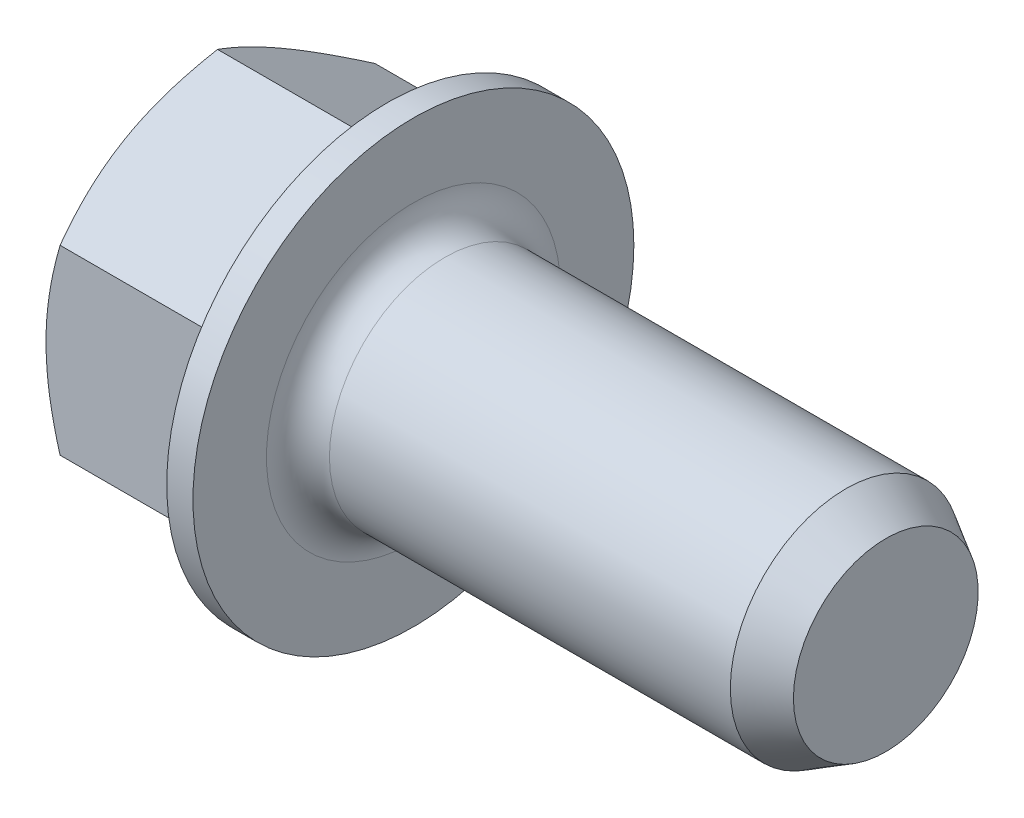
ISO-10303-21;
HEADER;
FILE_DESCRIPTION(('STEP AP214'),'2;1');
FILE_NAME('part.step','',(''),(''),'','','');
FILE_SCHEMA(('AUTOMOTIVE_DESIGN { 1 0 10303 214 1 1 1 1 }'));
ENDSEC;
DATA;
#1=APPLICATION_CONTEXT('core data for automotive mechanical design processes');
#2=APPLICATION_PROTOCOL_DEFINITION('international standard','automotive_design',2000,#1);
#3=PRODUCT_CONTEXT('',#1,'mechanical');
#4=PRODUCT('Part','Part','',(#3));
#5=PRODUCT_RELATED_PRODUCT_CATEGORY('part','',(#4));
#6=PRODUCT_DEFINITION_FORMATION('','',#4);
#7=PRODUCT_DEFINITION_CONTEXT('part definition',#1,'design');
#8=PRODUCT_DEFINITION('design','',#6,#7);
#9=PRODUCT_DEFINITION_SHAPE('','',#8);
#10=(LENGTH_UNIT() NAMED_UNIT(*) SI_UNIT(.MILLI.,.METRE.));
#11=(NAMED_UNIT(*) PLANE_ANGLE_UNIT() SI_UNIT($,.RADIAN.));
#12=(NAMED_UNIT(*) SI_UNIT($,.STERADIAN.) SOLID_ANGLE_UNIT());
#13=UNCERTAINTY_MEASURE_WITH_UNIT(LENGTH_MEASURE(1.E-05),#10,'distance_accuracy_value','');
#14=(GEOMETRIC_REPRESENTATION_CONTEXT(3) GLOBAL_UNCERTAINTY_ASSIGNED_CONTEXT((#13)) GLOBAL_UNIT_ASSIGNED_CONTEXT((#10,
#11,#12)) REPRESENTATION_CONTEXT('',''));
#15=CARTESIAN_POINT('',(0.,0.,0.));
#16=DIRECTION('',(0.,0.,1.));
#17=DIRECTION('',(1.,0.,0.));
#18=AXIS2_PLACEMENT_3D('',#15,#16,#17);
#19=CARTESIAN_POINT('',(0.,0.,0.));
#20=DIRECTION('',(-1.,0.,0.));
#21=DIRECTION('',(0.,0.,1.));
#22=AXIS2_PLACEMENT_3D('',#19,#20,#21);
#23=PLANE('',#22);
#24=CARTESIAN_POINT('',(0.,0.,0.));
#25=DIRECTION('',(-1.,0.,0.));
#26=DIRECTION('',(0.,0.,1.));
#27=AXIS2_PLACEMENT_3D('',#24,#25,#26);
#28=CIRCLE('',#27,1.5);
#29=CARTESIAN_POINT('',(0.,0.,1.5));
#30=VERTEX_POINT('',#29);
#31=CARTESIAN_POINT('',(0.,-1.29903810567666,0.75));
#32=VERTEX_POINT('',#31);
#33=EDGE_CURVE('E329',#30,#32,#28,.F.);
#34=ORIENTED_EDGE('',*,*,#33,.F.);
#35=CARTESIAN_POINT('',(0.,1.29903810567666,0.750000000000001));
#36=VERTEX_POINT('',#35);
#37=EDGE_CURVE('E140',#36,#30,#28,.F.);
#38=ORIENTED_EDGE('',*,*,#37,.F.);
#39=CARTESIAN_POINT('',(0.,1.29903810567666,-0.750000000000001));
#40=VERTEX_POINT('',#39);
#41=EDGE_CURVE('E333',#40,#36,#28,.F.);
#42=ORIENTED_EDGE('',*,*,#41,.F.);
#43=CARTESIAN_POINT('',(0.,0.,-1.5));
#44=VERTEX_POINT('',#43);
#45=EDGE_CURVE('E377',#44,#40,#28,.F.);
#46=ORIENTED_EDGE('',*,*,#45,.F.);
#47=CARTESIAN_POINT('',(0.,-1.29903810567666,-0.75));
#48=VERTEX_POINT('',#47);
#49=EDGE_CURVE('E382',#48,#44,#28,.F.);
#50=ORIENTED_EDGE('',*,*,#49,.F.);
#51=EDGE_CURVE('E357',#32,#48,#28,.F.);
#52=ORIENTED_EDGE('',*,*,#51,.F.);
#53=EDGE_LOOP('',(#34,#38,#42,#46,#50,#52));
#54=FACE_BOUND('',#53,.T.);
#55=CARTESIAN_POINT('',(0.,0.,0.));
#56=DIRECTION('',(-1.,0.,0.));
#57=DIRECTION('',(0.,0.,1.));
#58=AXIS2_PLACEMENT_3D('',#55,#56,#57);
#59=CIRCLE('',#58,1.2);
#60=CARTESIAN_POINT('',(0.,0.,1.2));
#61=VERTEX_POINT('',#60);
#62=EDGE_CURVE('E142',#61,#61,#59,.F.);
#63=ORIENTED_EDGE('',*,*,#62,.T.);
#64=EDGE_LOOP('',(#63));
#65=FACE_BOUND('',#64,.T.);
#66=ADVANCED_FACE('F35',(#54,#65),#23,.T.);
#67=CARTESIAN_POINT('',(1.75,1.32,0.));
#68=DIRECTION('',(-1.,0.,0.));
#69=DIRECTION('',(0.,0.,1.));
#70=AXIS2_PLACEMENT_3D('',#67,#68,#69);
#71=PLANE('',#70);
#72=DIRECTION('',(0.,0.5,0.866025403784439));
#73=VECTOR('',#72,1.);
#74=CARTESIAN_POINT('',(1.75,-1.90525588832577,0.1));
#75=LINE('',#74,#73);
#76=CARTESIAN_POINT('',(1.75,-0.981495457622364,1.7));
#77=VERTEX_POINT('',#76);
#78=CARTESIAN_POINT('',(1.75,-1.96299091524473,0.));
#79=VERTEX_POINT('',#78);
#80=EDGE_CURVE('E308',#77,#79,#75,.F.);
#81=ORIENTED_EDGE('',*,*,#80,.T.);
#82=DIRECTION('',(0.,-0.5,0.866025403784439));
#83=VECTOR('',#82,1.);
#84=CARTESIAN_POINT('',(1.75,-1.03923048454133,-1.6));
#85=LINE('',#84,#83);
#86=CARTESIAN_POINT('',(1.75,-0.981495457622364,-1.7));
#87=VERTEX_POINT('',#86);
#88=EDGE_CURVE('E302',#79,#87,#85,.F.);
#89=ORIENTED_EDGE('',*,*,#88,.T.);
#90=DIRECTION('',(0.,-1.,0.));
#91=VECTOR('',#90,1.);
#92=CARTESIAN_POINT('',(1.75,0.86602540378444,-1.7));
#93=LINE('',#92,#91);
#94=CARTESIAN_POINT('',(1.75,0.981495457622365,-1.7));
#95=VERTEX_POINT('',#94);
#96=EDGE_CURVE('E305',#87,#95,#93,.F.);
#97=ORIENTED_EDGE('',*,*,#96,.T.);
#98=DIRECTION('',(0.,-0.5,-0.866025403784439));
#99=VECTOR('',#98,1.);
#100=CARTESIAN_POINT('',(1.75,1.90525588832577,-0.1));
#101=LINE('',#100,#99);
#102=CARTESIAN_POINT('',(1.75,1.96299091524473,0.));
#103=VERTEX_POINT('',#102);
#104=EDGE_CURVE('E278',#95,#103,#101,.F.);
#105=ORIENTED_EDGE('',*,*,#104,.T.);
#106=DIRECTION('',(0.,0.5,-0.866025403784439));
#107=VECTOR('',#106,1.);
#108=CARTESIAN_POINT('',(1.75,1.03923048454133,1.6));
#109=LINE('',#108,#107);
#110=CARTESIAN_POINT('',(1.75,0.981495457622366,1.7));
#111=VERTEX_POINT('',#110);
#112=EDGE_CURVE('E312',#103,#111,#109,.F.);
#113=ORIENTED_EDGE('',*,*,#112,.T.);
#114=DIRECTION('',(0.,1.,0.));
#115=VECTOR('',#114,1.);
#116=CARTESIAN_POINT('',(1.75,-0.866025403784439,1.7));
#117=LINE('',#116,#115);
#118=EDGE_CURVE('E310',#111,#77,#117,.F.);
#119=ORIENTED_EDGE('',*,*,#118,.T.);
#120=EDGE_LOOP('',(#81,#89,#97,#105,#113,#119));
#121=FACE_BOUND('',#120,.T.);
#122=CARTESIAN_POINT('',(1.75,0.,0.));
#123=DIRECTION('',(1.,0.,0.));
#124=DIRECTION('',(0.,0.,-1.));
#125=AXIS2_PLACEMENT_3D('',#122,#123,#124);
#126=CIRCLE('',#125,2.1);
#127=CARTESIAN_POINT('',(1.75,0.,-2.1));
#128=VERTEX_POINT('',#127);
#129=EDGE_CURVE('E334',#128,#128,#126,.T.);
#130=ORIENTED_EDGE('',*,*,#129,.F.);
#131=EDGE_LOOP('',(#130));
#132=FACE_BOUND('',#131,.T.);
#133=ADVANCED_FACE('F230',(#121,#132),#71,.T.);
#134=CARTESIAN_POINT('',(13.1078858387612,0.,0.));
#135=DIRECTION('',(1.,0.,0.));
#136=DIRECTION('',(0.,0.,-1.));
#137=AXIS2_PLACEMENT_3D('',#134,#135,#136);
#138=CYLINDRICAL_SURFACE('',#137,2.1);
#139=ORIENTED_EDGE('',*,*,#129,.T.);
#140=EDGE_LOOP('',(#139));
#141=FACE_BOUND('',#140,.T.);
#142=CARTESIAN_POINT('',(2.,0.,0.));
#143=DIRECTION('',(1.,0.,0.));
#144=DIRECTION('',(0.,0.,-1.));
#145=AXIS2_PLACEMENT_3D('',#142,#143,#144);
#146=CIRCLE('',#145,2.1);
#147=CARTESIAN_POINT('',(2.,0.,-2.1));
#148=VERTEX_POINT('',#147);
#149=EDGE_CURVE('E337',#148,#148,#146,.T.);
#150=ORIENTED_EDGE('',*,*,#149,.F.);
#151=EDGE_LOOP('',(#150));
#152=FACE_BOUND('',#151,.T.);
#153=ADVANCED_FACE('F236',(#141,#152),#138,.T.);
#154=CARTESIAN_POINT('',(2.,2.1,0.));
#155=DIRECTION('',(1.,0.,0.));
#156=DIRECTION('',(0.,0.,-1.));
#157=AXIS2_PLACEMENT_3D('',#154,#155,#156);
#158=PLANE('',#157);
#159=CARTESIAN_POINT('',(2.,0.,0.));
#160=DIRECTION('',(1.,0.,0.));
#161=DIRECTION('',(0.,0.,-1.));
#162=AXIS2_PLACEMENT_3D('',#159,#160,#161);
#163=CIRCLE('',#162,1.4);
#164=CARTESIAN_POINT('',(2.,0.,-1.4));
#165=VERTEX_POINT('',#164);
#166=EDGE_CURVE('E317',#165,#165,#163,.F.);
#167=ORIENTED_EDGE('',*,*,#166,.T.);
#168=EDGE_LOOP('',(#167));
#169=FACE_BOUND('',#168,.T.);
#170=ORIENTED_EDGE('',*,*,#149,.T.);
#171=EDGE_LOOP('',(#170));
#172=FACE_BOUND('',#171,.T.);
#173=ADVANCED_FACE('F508',(#169,#172),#158,.T.);
#174=CARTESIAN_POINT('',(13.1078858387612,0.,0.));
#175=DIRECTION('',(1.,0.,0.));
#176=DIRECTION('',(0.,0.,-1.));
#177=AXIS2_PLACEMENT_3D('',#174,#175,#176);
#178=CYLINDRICAL_SURFACE('',#177,1.1);
#179=CARTESIAN_POINT('',(2.3,0.,0.));
#180=DIRECTION('',(1.,0.,0.));
#181=DIRECTION('',(0.,0.,-1.));
#182=AXIS2_PLACEMENT_3D('',#179,#180,#181);
#183=CIRCLE('',#182,1.1);
#184=CARTESIAN_POINT('',(2.3,0.,-1.1));
#185=VERTEX_POINT('',#184);
#186=EDGE_CURVE('E320',#185,#185,#183,.T.);
#187=ORIENTED_EDGE('',*,*,#186,.T.);
#188=EDGE_LOOP('',(#187));
#189=FACE_BOUND('',#188,.T.);
#190=CARTESIAN_POINT('',(6.11894882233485,0.,0.));
#191=DIRECTION('',(1.,0.,0.));
#192=DIRECTION('',(0.,0.,-1.));
#193=AXIS2_PLACEMENT_3D('',#190,#191,#192);
#194=CIRCLE('',#193,1.1);
#195=CARTESIAN_POINT('',(6.11894882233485,0.,1.1));
#196=VERTEX_POINT('',#195);
#197=EDGE_CURVE('E323',#196,#196,#194,.F.);
#198=ORIENTED_EDGE('',*,*,#197,.T.);
#199=EDGE_LOOP('',(#198));
#200=FACE_BOUND('',#199,.T.);
#201=ADVANCED_FACE('F514',(#189,#200),#178,.T.);
#202=CARTESIAN_POINT('',(6.5,1.1,0.));
#203=DIRECTION('',(1.,0.,0.));
#204=DIRECTION('',(0.,0.,-1.));
#205=AXIS2_PLACEMENT_3D('',#202,#203,#204);
#206=PLANE('',#205);
#207=CARTESIAN_POINT('',(6.5,0.,0.));
#208=DIRECTION('',(1.,0.,0.));
#209=DIRECTION('',(0.,0.,-1.));
#210=AXIS2_PLACEMENT_3D('',#207,#208,#209);
#211=CIRCLE('',#210,0.879999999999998);
#212=CARTESIAN_POINT('',(6.5,0.,0.879999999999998));
#213=VERTEX_POINT('',#212);
#214=EDGE_CURVE('E326',#213,#213,#211,.T.);
#215=ORIENTED_EDGE('',*,*,#214,.T.);
#216=EDGE_LOOP('',(#215));
#217=FACE_BOUND('',#216,.T.);
#218=ADVANCED_FACE('F492',(#217),#206,.T.);
#219=CARTESIAN_POINT('',(2.,-1.73205080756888,0.));
#220=DIRECTION('',(0.,-0.866025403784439,0.5));
#221=DIRECTION('',(0.,-0.5,-0.866025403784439));
#222=AXIS2_PLACEMENT_3D('',#219,#220,#221);
#223=PLANE('',#222);
#224=DIRECTION('',(-1.,0.,0.));
#225=VECTOR('',#224,1.);
#226=CARTESIAN_POINT('',(2.,-1.73205080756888,0.));
#227=LINE('',#226,#225);
#228=CARTESIAN_POINT('',(1.55,-1.73205080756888,0.));
#229=VERTEX_POINT('',#228);
#230=CARTESIAN_POINT('',(0.133974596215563,-1.73205080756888,0.));
#231=VERTEX_POINT('',#230);
#232=EDGE_CURVE('E340',#229,#231,#227,.T.);
#233=ORIENTED_EDGE('',*,*,#232,.F.);
#234=DIRECTION('',(0.,0.5,0.866025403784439));
#235=VECTOR('',#234,1.);
#236=CARTESIAN_POINT('',(1.55,-0.866025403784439,1.5));
#237=LINE('',#236,#235);
#238=CARTESIAN_POINT('',(1.55,-0.866025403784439,1.5));
#239=VERTEX_POINT('',#238);
#240=EDGE_CURVE('E59',#229,#239,#237,.T.);
#241=ORIENTED_EDGE('',*,*,#240,.T.);
#242=DIRECTION('',(-1.,0.,0.));
#243=VECTOR('',#242,1.);
#244=CARTESIAN_POINT('',(2.,-0.866025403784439,1.5));
#245=LINE('',#244,#243);
#246=CARTESIAN_POINT('',(0.133974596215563,-0.866025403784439,1.5));
#247=VERTEX_POINT('',#246);
#248=EDGE_CURVE('E132',#239,#247,#245,.T.);
#249=ORIENTED_EDGE('',*,*,#248,.T.);
#250=CARTESIAN_POINT('',(0.134041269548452,-1.73216627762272,-0.000199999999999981));
#251=CARTESIAN_POINT('',(0.112057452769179,-1.69410775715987,0.0657192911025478));
#252=CARTESIAN_POINT('',(0.0920634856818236,-1.65572072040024,0.132207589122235));
#253=CARTESIAN_POINT('',(0.0571626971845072,-1.5782818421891,0.266335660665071));
#254=CARTESIAN_POINT('',(0.0422682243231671,-1.53922862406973,0.333977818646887));
#255=CARTESIAN_POINT('',(0.019081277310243,-1.4616062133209,0.468423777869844));
#256=CARTESIAN_POINT('',(0.0106345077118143,-1.42304896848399,0.535206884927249));
#257=CARTESIAN_POINT('',(0.000548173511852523,-1.34575291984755,0.669087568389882));
#258=CARTESIAN_POINT('',(-0.00109974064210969,-1.30701439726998,0.73618465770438));
#259=CARTESIAN_POINT('',(0.00231621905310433,-1.23462040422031,0.861574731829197));
#260=CARTESIAN_POINT('',(0.00654135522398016,-1.20095413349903,0.919886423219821));
#261=CARTESIAN_POINT('',(0.0199363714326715,-1.13384094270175,1.03612987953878));
#262=CARTESIAN_POINT('',(0.0291108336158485,-1.10039425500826,1.09406124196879));
#263=CARTESIAN_POINT('',(0.0520477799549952,-1.03314252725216,1.21054465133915));
#264=CARTESIAN_POINT('',(0.0659075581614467,-0.999346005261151,1.26908194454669));
#265=CARTESIAN_POINT('',(0.0973643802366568,-0.932257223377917,1.38528312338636));
#266=CARTESIAN_POINT('',(0.114954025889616,-0.898964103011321,1.44294849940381));
#267=CARTESIAN_POINT('',(0.134041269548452,-0.865909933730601,1.5002));
#268=B_SPLINE_CURVE_WITH_KNOTS('',3,(#250,#251,#252,#253,#254,#255,#256,#257,#258,#259,#260,
#261,#262,#263,#264,#265,#266,#267),.UNSPECIFIED.,.F.,.F.,(4,2,2,2,2,2,2,2,4),(0.,
0.237777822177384,0.47612742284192,0.708577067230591,0.940741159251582,1.14294352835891,
1.34533342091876,1.55221450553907,1.75868901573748),.UNSPECIFIED.);
#269=EDGE_CURVE('E149',#32,#247,#268,.T.);
#270=ORIENTED_EDGE('',*,*,#269,.F.);
#271=EDGE_CURVE('E153',#231,#32,#268,.T.);
#272=ORIENTED_EDGE('',*,*,#271,.F.);
#273=EDGE_LOOP('',(#233,#241,#249,#270,#272));
#274=FACE_BOUND('',#273,.T.);
#275=ADVANCED_FACE('F360',(#274),#223,.T.);
#276=CARTESIAN_POINT('',(2.,-0.866025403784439,-1.5));
#277=DIRECTION('',(0.,-0.866025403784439,-0.5));
#278=DIRECTION('',(0.,0.5,-0.866025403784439));
#279=AXIS2_PLACEMENT_3D('',#276,#277,#278);
#280=PLANE('',#279);
#281=DIRECTION('',(-1.,0.,0.));
#282=VECTOR('',#281,1.);
#283=CARTESIAN_POINT('',(2.,-0.866025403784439,-1.5));
#284=LINE('',#283,#282);
#285=CARTESIAN_POINT('',(1.55,-0.866025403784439,-1.5));
#286=VERTEX_POINT('',#285);
#287=CARTESIAN_POINT('',(0.13397459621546,-0.866025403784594,-1.5));
#288=VERTEX_POINT('',#287);
#289=EDGE_CURVE('E345',#286,#288,#284,.T.);
#290=ORIENTED_EDGE('',*,*,#289,.F.);
#291=DIRECTION('',(0.,-0.5,0.866025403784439));
#292=VECTOR('',#291,1.);
#293=CARTESIAN_POINT('',(1.55,-1.73205080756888,0.));
#294=LINE('',#293,#292);
#295=EDGE_CURVE('E314',#286,#229,#294,.T.);
#296=ORIENTED_EDGE('',*,*,#295,.T.);
#297=ORIENTED_EDGE('',*,*,#232,.T.);
#298=CARTESIAN_POINT('',(0.134041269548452,-0.865909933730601,-1.5002));
#299=CARTESIAN_POINT('',(0.112057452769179,-0.903968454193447,-1.43428070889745));
#300=CARTESIAN_POINT('',(0.0920634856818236,-0.942355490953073,-1.36779241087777));
#301=CARTESIAN_POINT('',(0.0571626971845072,-1.01979436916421,-1.23366433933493));
#302=CARTESIAN_POINT('',(0.042268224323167,-1.05884758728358,-1.16602218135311));
#303=CARTESIAN_POINT('',(0.0190812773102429,-1.13646999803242,-1.03157622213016));
#304=CARTESIAN_POINT('',(0.0106345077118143,-1.17502724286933,-0.964793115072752));
#305=CARTESIAN_POINT('',(0.000548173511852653,-1.25232329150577,-0.830912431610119));
#306=CARTESIAN_POINT('',(-0.00109974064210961,-1.29106181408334,-0.763815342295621));
#307=CARTESIAN_POINT('',(0.0023162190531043,-1.36345580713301,-0.638425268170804));
#308=CARTESIAN_POINT('',(0.00654135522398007,-1.39712207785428,-0.58011357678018));
#309=CARTESIAN_POINT('',(0.0199363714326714,-1.46423526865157,-0.463870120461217));
#310=CARTESIAN_POINT('',(0.0291108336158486,-1.49768195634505,-0.405938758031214));
#311=CARTESIAN_POINT('',(0.0520477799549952,-1.56493368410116,-0.289455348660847));
#312=CARTESIAN_POINT('',(0.0659075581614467,-1.59873020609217,-0.230918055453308));
#313=CARTESIAN_POINT('',(0.0973643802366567,-1.6658189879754,-0.11471687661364));
#314=CARTESIAN_POINT('',(0.114954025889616,-1.699112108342,-0.0570515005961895));
#315=CARTESIAN_POINT('',(0.134041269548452,-1.73216627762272,0.000199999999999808));
#316=B_SPLINE_CURVE_WITH_KNOTS('',3,(#298,#299,#300,#301,#302,#303,#304,#305,#306,#307,#308,
#309,#310,#311,#312,#313,#314,#315),.UNSPECIFIED.,.F.,.F.,(4,2,2,2,2,2,2,2,4),(0.,
0.237777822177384,0.47612742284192,0.708577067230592,0.940741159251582,1.14294352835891,
1.34533342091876,1.55221450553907,1.75868901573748),.UNSPECIFIED.);
#317=EDGE_CURVE('E351',#48,#231,#316,.T.);
#318=ORIENTED_EDGE('',*,*,#317,.F.);
#319=EDGE_CURVE('E210',#288,#48,#316,.T.);
#320=ORIENTED_EDGE('',*,*,#319,.F.);
#321=EDGE_LOOP('',(#290,#296,#297,#318,#320));
#322=FACE_BOUND('',#321,.T.);
#323=ADVANCED_FACE('F185',(#322),#280,.T.);
#324=CARTESIAN_POINT('',(2.,0.86602540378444,-1.5));
#325=DIRECTION('',(0.,0.,-1.));
#326=DIRECTION('',(0.,1.,0.));
#327=AXIS2_PLACEMENT_3D('',#324,#325,#326);
#328=PLANE('',#327);
#329=DIRECTION('',(-1.,0.,0.));
#330=VECTOR('',#329,1.);
#331=CARTESIAN_POINT('',(2.,0.86602540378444,-1.5));
#332=LINE('',#331,#330);
#333=CARTESIAN_POINT('',(1.55,0.86602540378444,-1.5));
#334=VERTEX_POINT('',#333);
#335=CARTESIAN_POINT('',(0.133974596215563,0.86602540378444,-1.5));
#336=VERTEX_POINT('',#335);
#337=EDGE_CURVE('E343',#334,#336,#332,.T.);
#338=ORIENTED_EDGE('',*,*,#337,.F.);
#339=DIRECTION('',(0.,-1.,0.));
#340=VECTOR('',#339,1.);
#341=CARTESIAN_POINT('',(1.55,-0.866025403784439,-1.5));
#342=LINE('',#341,#340);
#343=EDGE_CURVE('E300',#334,#286,#342,.T.);
#344=ORIENTED_EDGE('',*,*,#343,.T.);
#345=ORIENTED_EDGE('',*,*,#289,.T.);
#346=CARTESIAN_POINT('',(0.738325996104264,-2.33919435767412,-1.5));
#347=CARTESIAN_POINT('',(0.706429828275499,-2.27354807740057,-1.5));
#348=CARTESIAN_POINT('',(0.674835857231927,-2.20775243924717,-1.5));
#349=CARTESIAN_POINT('',(0.61242209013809,-2.07578302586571,-1.5));
#350=CARTESIAN_POINT('',(0.581602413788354,-2.00960919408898,-1.5));
#351=CARTESIAN_POINT('',(0.52075485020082,-1.87646946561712,-1.5));
#352=CARTESIAN_POINT('',(0.490732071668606,-1.8095012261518,-1.5));
#353=CARTESIAN_POINT('',(0.431898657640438,-1.67503635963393,-1.5));
#354=CARTESIAN_POINT('',(0.403087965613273,-1.60753975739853,-1.5));
#355=CARTESIAN_POINT('',(0.3460959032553,-1.46972834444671,-1.5));
#356=CARTESIAN_POINT('',(0.317964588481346,-1.39939272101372,-1.5));
#357=CARTESIAN_POINT('',(0.263799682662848,-1.25790302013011,-1.5));
#358=CARTESIAN_POINT('',(0.237766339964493,-1.18674884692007,-1.5));
#359=CARTESIAN_POINT('',(0.188472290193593,-1.04364123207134,-1.5));
#360=CARTESIAN_POINT('',(0.165205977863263,-0.971689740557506,-1.5));
#361=CARTESIAN_POINT('',(0.122180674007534,-0.826749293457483,-1.5));
#362=CARTESIAN_POINT('',(0.102420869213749,-0.753760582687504,-1.5));
#363=CARTESIAN_POINT('',(0.0674513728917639,-0.607097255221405,-1.5));
#364=CARTESIAN_POINT('',(0.0522177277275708,-0.533428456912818,-1.5));
#365=CARTESIAN_POINT('',(0.0271589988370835,-0.385162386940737,-1.5));
#366=CARTESIAN_POINT('',(0.0173333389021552,-0.310565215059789,-1.5));
#367=CARTESIAN_POINT('',(0.00400490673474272,-0.161791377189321,-1.5));
#368=CARTESIAN_POINT('',(0.000419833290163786,-0.0876222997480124,-1.5));
#369=CARTESIAN_POINT('',(-0.000350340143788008,0.06074835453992,-1.5));
#370=CARTESIAN_POINT('',(0.00246477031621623,0.134949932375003,-1.5));
#371=CARTESIAN_POINT('',(0.0165841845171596,0.312123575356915,-1.5));
#372=CARTESIAN_POINT('',(0.030806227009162,0.414864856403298,-1.5));
#373=CARTESIAN_POINT('',(0.0690676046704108,0.618500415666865,-1.5));
#374=CARTESIAN_POINT('',(0.0931159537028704,0.719392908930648,-1.5));
#375=CARTESIAN_POINT('',(0.149050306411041,0.921522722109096,-1.5));
#376=CARTESIAN_POINT('',(0.181109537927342,1.02271089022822,-1.5));
#377=CARTESIAN_POINT('',(0.233143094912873,1.17307801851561,-1.5));
#378=CARTESIAN_POINT('',(0.251143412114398,1.22296046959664,-1.5));
#379=CARTESIAN_POINT('',(0.288252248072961,1.32231106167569,-1.5));
#380=CARTESIAN_POINT('',(0.307360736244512,1.37177921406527,-1.5));
#381=CARTESIAN_POINT('',(0.363332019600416,1.51274665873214,-1.5));
#382=CARTESIAN_POINT('',(0.401327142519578,1.60379543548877,-1.5));
#383=CARTESIAN_POINT('',(0.479619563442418,1.78490166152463,-1.5));
#384=CARTESIAN_POINT('',(0.519917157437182,1.87495898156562,-1.5));
#385=CARTESIAN_POINT('',(0.602227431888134,2.05432773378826,-1.5));
#386=CARTESIAN_POINT('',(0.644240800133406,2.14363884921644,-1.5));
#387=CARTESIAN_POINT('',(0.729551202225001,2.32164710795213,-1.5));
#388=CARTESIAN_POINT('',(0.772848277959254,2.41034423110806,-1.5));
#389=CARTESIAN_POINT('',(0.904348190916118,2.67601588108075,-1.5));
#390=CARTESIAN_POINT('',(0.99401624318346,2.85226403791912,-1.5));
#391=CARTESIAN_POINT('',(1.17572346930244,3.20346942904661,-1.5));
#392=CARTESIAN_POINT('',(1.26776205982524,3.37842696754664,-1.5));
#393=CARTESIAN_POINT('',(1.44271713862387,3.70735338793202,-1.5));
#394=CARTESIAN_POINT('',(1.52546062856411,3.86141442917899,-1.5));
#395=CARTESIAN_POINT('',(1.69185044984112,4.1690618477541,-1.5));
#396=CARTESIAN_POINT('',(1.77549684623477,4.32264818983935,-1.5));
#397=CARTESIAN_POINT('',(1.94315602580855,4.62891657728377,-1.5));
#398=CARTESIAN_POINT('',(2.02716647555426,4.78159990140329,-1.5));
#399=CARTESIAN_POINT('',(2.19569042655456,5.08667135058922,-1.5));
#400=CARTESIAN_POINT('',(2.28020388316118,5.23905950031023,-1.5));
#401=CARTESIAN_POINT('',(2.36489875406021,5.39134609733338,-1.5));
#402=B_SPLINE_CURVE_WITH_KNOTS('',3,(#346,#347,#348,#349,#350,#351,#352,#353,#354,#355,#356,
#357,#358,#359,#360,#361,#362,#363,#364,#365,#366,#367,#368,#369,#370,#371,#372,#373,#374,#375,
#376,#377,#378,#379,#380,#381,#382,#383,#384,#385,#386,#387,#388,#389,#390,#391,#392,#393,#394,
#395,#396,#397,#398,#399,#400,#401),.UNSPECIFIED.,.F.,.F.,(4,2,2,2,2,2,2,2,2,2,2,2,2,2,2,2,2,2,
2,2,2,2,2,2,2,2,2,4),(0.,0.218957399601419,0.437948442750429,0.658109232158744,
0.878259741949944,1.10549194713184,1.33275101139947,1.55954157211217,1.78627946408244,
2.01179510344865,2.23728670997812,2.45978132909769,2.68228326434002,2.99280614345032,
3.30361451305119,3.62183468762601,3.78091843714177,3.9399977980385,4.23592474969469,
4.53188982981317,4.82797473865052,5.12406931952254,5.71727387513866,6.31033382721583,
6.83495484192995,7.35961391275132,7.882422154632,8.40518466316),.UNSPECIFIED.);
#403=EDGE_CURVE('E209',#44,#288,#402,.F.);
#404=ORIENTED_EDGE('',*,*,#403,.F.);
#405=EDGE_CURVE('E204',#336,#44,#402,.F.);
#406=ORIENTED_EDGE('',*,*,#405,.F.);
#407=EDGE_LOOP('',(#338,#344,#345,#404,#406));
#408=FACE_BOUND('',#407,.T.);
#409=ADVANCED_FACE('F216',(#408),#328,.T.);
#410=CARTESIAN_POINT('',(2.,1.73205080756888,0.));
#411=DIRECTION('',(0.,0.866025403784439,-0.5));
#412=DIRECTION('',(0.,0.5,0.866025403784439));
#413=AXIS2_PLACEMENT_3D('',#410,#411,#412);
#414=PLANE('',#413);
#415=DIRECTION('',(-1.,0.,0.));
#416=VECTOR('',#415,1.);
#417=CARTESIAN_POINT('',(2.,1.73205080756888,0.));
#418=LINE('',#417,#416);
#419=CARTESIAN_POINT('',(1.55,1.73205080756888,0.));
#420=VERTEX_POINT('',#419);
#421=CARTESIAN_POINT('',(0.133974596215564,1.73205080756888,0.));
#422=VERTEX_POINT('',#421);
#423=EDGE_CURVE('E131',#420,#422,#418,.T.);
#424=ORIENTED_EDGE('',*,*,#423,.F.);
#425=DIRECTION('',(0.,-0.5,-0.866025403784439));
#426=VECTOR('',#425,1.);
#427=CARTESIAN_POINT('',(1.55,0.86602540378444,-1.5));
#428=LINE('',#427,#426);
#429=EDGE_CURVE('E280',#420,#334,#428,.T.);
#430=ORIENTED_EDGE('',*,*,#429,.T.);
#431=ORIENTED_EDGE('',*,*,#337,.T.);
#432=CARTESIAN_POINT('',(0.134041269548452,1.73216627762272,0.000199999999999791));
#433=CARTESIAN_POINT('',(0.11205745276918,1.69410775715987,-0.065719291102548));
#434=CARTESIAN_POINT('',(0.0920634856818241,1.65572072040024,-0.132207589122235));
#435=CARTESIAN_POINT('',(0.0571626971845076,1.5782818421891,-0.266335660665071));
#436=CARTESIAN_POINT('',(0.0422682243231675,1.53922862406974,-0.333977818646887));
#437=CARTESIAN_POINT('',(0.0190812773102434,1.4616062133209,-0.468423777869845));
#438=CARTESIAN_POINT('',(0.010634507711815,1.42304896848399,-0.535206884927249));
#439=CARTESIAN_POINT('',(0.000548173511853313,1.34575291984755,-0.669087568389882));
#440=CARTESIAN_POINT('',(-0.00109974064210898,1.30701439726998,-0.73618465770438));
#441=CARTESIAN_POINT('',(0.00231621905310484,1.23462040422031,-0.861574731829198));
#442=CARTESIAN_POINT('',(0.00654135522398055,1.20095413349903,-0.919886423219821));
#443=CARTESIAN_POINT('',(0.0199363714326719,1.13384094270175,-1.03612987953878));
#444=CARTESIAN_POINT('',(0.0291108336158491,1.10039425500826,-1.09406124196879));
#445=CARTESIAN_POINT('',(0.0520477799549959,1.03314252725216,-1.21054465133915));
#446=CARTESIAN_POINT('',(0.0659075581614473,0.999346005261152,-1.26908194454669));
#447=CARTESIAN_POINT('',(0.0973643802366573,0.932257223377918,-1.38528312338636));
#448=CARTESIAN_POINT('',(0.114954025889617,0.898964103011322,-1.44294849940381));
#449=CARTESIAN_POINT('',(0.134041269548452,0.865909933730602,-1.5002));
#450=B_SPLINE_CURVE_WITH_KNOTS('',3,(#432,#433,#434,#435,#436,#437,#438,#439,#440,#441,#442,
#443,#444,#445,#446,#447,#448,#449),.UNSPECIFIED.,.F.,.F.,(4,2,2,2,2,2,2,2,4),(0.,
0.237777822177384,0.47612742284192,0.708577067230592,0.940741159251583,1.14294352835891,
1.34533342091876,1.55221450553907,1.75868901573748),.UNSPECIFIED.);
#451=EDGE_CURVE('E163',#40,#336,#450,.T.);
#452=ORIENTED_EDGE('',*,*,#451,.F.);
#453=EDGE_CURVE('E160',#422,#40,#450,.T.);
#454=ORIENTED_EDGE('',*,*,#453,.F.);
#455=EDGE_LOOP('',(#424,#430,#431,#452,#454));
#456=FACE_BOUND('',#455,.T.);
#457=ADVANCED_FACE('F219',(#456),#414,.T.);
#458=CARTESIAN_POINT('',(2.,0.866025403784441,1.5));
#459=DIRECTION('',(0.,0.866025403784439,0.5));
#460=DIRECTION('',(0.,-0.5,0.866025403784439));
#461=AXIS2_PLACEMENT_3D('',#458,#459,#460);
#462=PLANE('',#461);
#463=DIRECTION('',(-1.,0.,0.));
#464=VECTOR('',#463,1.);
#465=CARTESIAN_POINT('',(2.,0.866025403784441,1.5));
#466=LINE('',#465,#464);
#467=CARTESIAN_POINT('',(1.55,0.866025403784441,1.5));
#468=VERTEX_POINT('',#467);
#469=CARTESIAN_POINT('',(0.133974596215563,0.866025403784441,1.5));
#470=VERTEX_POINT('',#469);
#471=EDGE_CURVE('E123',#468,#470,#466,.T.);
#472=ORIENTED_EDGE('',*,*,#471,.F.);
#473=DIRECTION('',(0.,0.5,-0.866025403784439));
#474=VECTOR('',#473,1.);
#475=CARTESIAN_POINT('',(1.55,1.73205080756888,0.));
#476=LINE('',#475,#474);
#477=EDGE_CURVE('E11',#468,#420,#476,.T.);
#478=ORIENTED_EDGE('',*,*,#477,.T.);
#479=ORIENTED_EDGE('',*,*,#423,.T.);
#480=CARTESIAN_POINT('',(0.134041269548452,0.865909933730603,1.5002));
#481=CARTESIAN_POINT('',(0.112057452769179,0.903968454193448,1.43428070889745));
#482=CARTESIAN_POINT('',(0.0920634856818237,0.942355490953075,1.36779241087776));
#483=CARTESIAN_POINT('',(0.0571626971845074,1.01979436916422,1.23366433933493));
#484=CARTESIAN_POINT('',(0.0422682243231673,1.05884758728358,1.16602218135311));
#485=CARTESIAN_POINT('',(0.0190812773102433,1.13646999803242,1.03157622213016));
#486=CARTESIAN_POINT('',(0.0106345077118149,1.17502724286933,0.964793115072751));
#487=CARTESIAN_POINT('',(0.000548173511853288,1.25232329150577,0.830912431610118));
#488=CARTESIAN_POINT('',(-0.00109974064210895,1.29106181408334,0.76381534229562));
#489=CARTESIAN_POINT('',(0.00231621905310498,1.36345580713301,0.638425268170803));
#490=CARTESIAN_POINT('',(0.00654135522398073,1.39712207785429,0.580113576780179));
#491=CARTESIAN_POINT('',(0.0199363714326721,1.46423526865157,0.463870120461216));
#492=CARTESIAN_POINT('',(0.0291108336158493,1.49768195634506,0.405938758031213));
#493=CARTESIAN_POINT('',(0.052047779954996,1.56493368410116,0.289455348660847));
#494=CARTESIAN_POINT('',(0.0659075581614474,1.59873020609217,0.230918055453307));
#495=CARTESIAN_POINT('',(0.0973643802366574,1.6658189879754,0.11471687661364));
#496=CARTESIAN_POINT('',(0.114954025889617,1.699112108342,0.0570515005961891));
#497=CARTESIAN_POINT('',(0.134041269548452,1.73216627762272,-0.000200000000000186));
#498=B_SPLINE_CURVE_WITH_KNOTS('',3,(#480,#481,#482,#483,#484,#485,#486,#487,#488,#489,#490,
#491,#492,#493,#494,#495,#496,#497),.UNSPECIFIED.,.F.,.F.,(4,2,2,2,2,2,2,2,4),(0.,
0.237777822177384,0.47612742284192,0.708577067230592,0.940741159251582,1.14294352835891,
1.34533342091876,1.55221450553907,1.75868901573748),.UNSPECIFIED.);
#499=EDGE_CURVE('E148',#36,#422,#498,.T.);
#500=ORIENTED_EDGE('',*,*,#499,.F.);
#501=EDGE_CURVE('E138',#470,#36,#498,.T.);
#502=ORIENTED_EDGE('',*,*,#501,.F.);
#503=EDGE_LOOP('',(#472,#478,#479,#500,#502));
#504=FACE_BOUND('',#503,.T.);
#505=ADVANCED_FACE('F146',(#504),#462,.T.);
#506=CARTESIAN_POINT('',(2.,-0.866025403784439,1.5));
#507=DIRECTION('',(0.,0.,1.));
#508=DIRECTION('',(0.,-1.,0.));
#509=AXIS2_PLACEMENT_3D('',#506,#507,#508);
#510=PLANE('',#509);
#511=ORIENTED_EDGE('',*,*,#248,.F.);
#512=DIRECTION('',(0.,1.,0.));
#513=VECTOR('',#512,1.);
#514=CARTESIAN_POINT('',(1.55,0.866025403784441,1.5));
#515=LINE('',#514,#513);
#516=EDGE_CURVE('E44',#239,#468,#515,.T.);
#517=ORIENTED_EDGE('',*,*,#516,.T.);
#518=ORIENTED_EDGE('',*,*,#471,.T.);
#519=CARTESIAN_POINT('',(0.738325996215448,-2.33919435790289,1.5));
#520=CARTESIAN_POINT('',(0.706429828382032,-2.27354807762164,1.5));
#521=CARTESIAN_POINT('',(0.674835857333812,-2.20775243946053,1.5));
#522=CARTESIAN_POINT('',(0.612422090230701,-2.07578302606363,1.5));
#523=CARTESIAN_POINT('',(0.58160241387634,-2.00960919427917,1.5));
#524=CARTESIAN_POINT('',(0.520754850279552,-1.87646946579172,1.5));
#525=CARTESIAN_POINT('',(0.490732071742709,-1.80950122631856,1.5));
#526=CARTESIAN_POINT('',(0.431898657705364,-1.67503635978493,1.5));
#527=CARTESIAN_POINT('',(0.403087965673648,-1.60753975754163,1.5));
#528=CARTESIAN_POINT('',(0.346095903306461,-1.46972834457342,1.5));
#529=CARTESIAN_POINT('',(0.317964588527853,-1.39939272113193,1.5));
#530=CARTESIAN_POINT('',(0.263799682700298,-1.25790302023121,1.5));
#531=CARTESIAN_POINT('',(0.237766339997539,-1.18674884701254,1.5));
#532=CARTESIAN_POINT('',(0.188472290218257,-1.0436412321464,1.5));
#533=CARTESIAN_POINT('',(0.165205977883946,-0.971689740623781,1.5));
#534=CARTESIAN_POINT('',(0.122180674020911,-0.826749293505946,1.5));
#535=CARTESIAN_POINT('',(0.102420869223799,-0.75376058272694,1.5));
#536=CARTESIAN_POINT('',(0.0674513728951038,-0.607097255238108,1.5));
#537=CARTESIAN_POINT('',(0.0522177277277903,-0.533428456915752,1.5));
#538=CARTESIAN_POINT('',(0.0271589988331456,-0.385162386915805,1.5));
#539=CARTESIAN_POINT('',(0.0173333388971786,-0.310565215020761,1.5));
#540=CARTESIAN_POINT('',(0.00400490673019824,-0.16179137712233,1.5));
#541=CARTESIAN_POINT('',(0.000419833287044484,-0.087622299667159,1.5));
#542=CARTESIAN_POINT('',(-0.000350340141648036,0.0607483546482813,1.5));
#543=CARTESIAN_POINT('',(0.00246477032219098,0.134949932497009,1.5));
#544=CARTESIAN_POINT('',(0.0165841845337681,0.312123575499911,1.5));
#545=CARTESIAN_POINT('',(0.0308062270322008,0.414864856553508,1.5));
#546=CARTESIAN_POINT('',(0.0690676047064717,0.618500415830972,1.5));
#547=CARTESIAN_POINT('',(0.0931159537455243,0.719392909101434,1.5));
#548=CARTESIAN_POINT('',(0.149050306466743,0.921522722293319,1.5));
#549=CARTESIAN_POINT('',(0.181109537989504,1.02271089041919,1.5));
#550=CARTESIAN_POINT('',(0.233143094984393,1.17307801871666,1.5));
#551=CARTESIAN_POINT('',(0.25114341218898,1.22296046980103,1.5));
#552=CARTESIAN_POINT('',(0.288252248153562,1.32231106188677,1.5));
#553=CARTESIAN_POINT('',(0.307360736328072,1.3717792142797,1.5));
#554=CARTESIAN_POINT('',(0.363332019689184,1.51274665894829,1.5));
#555=CARTESIAN_POINT('',(0.401327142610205,1.60379543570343,1.5));
#556=CARTESIAN_POINT('',(0.479619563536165,1.78490166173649,1.5));
#557=CARTESIAN_POINT('',(0.51991715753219,1.87495898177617,1.5));
#558=CARTESIAN_POINT('',(0.602227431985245,2.05432773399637,1.5));
#559=CARTESIAN_POINT('',(0.644240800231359,2.14363884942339,1.5));
#560=CARTESIAN_POINT('',(0.729551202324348,2.32164710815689,1.5));
#561=CARTESIAN_POINT('',(0.772848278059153,2.41034423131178,1.5));
#562=CARTESIAN_POINT('',(0.904348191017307,2.67601588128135,1.5));
#563=CARTESIAN_POINT('',(0.994016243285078,2.85226403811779,1.5));
#564=CARTESIAN_POINT('',(1.1757234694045,3.20346942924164,1.5));
#565=CARTESIAN_POINT('',(1.26776205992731,3.37842696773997,1.5));
#566=CARTESIAN_POINT('',(1.44271713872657,3.70735338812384,1.5));
#567=CARTESIAN_POINT('',(1.52546062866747,3.86141442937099,1.5));
#568=CARTESIAN_POINT('',(1.69185044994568,4.16906184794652,1.5));
#569=CARTESIAN_POINT('',(1.77549684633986,4.322648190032,1.5));
#570=CARTESIAN_POINT('',(1.94315602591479,4.62891657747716,1.5));
#571=CARTESIAN_POINT('',(2.02716647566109,4.78159990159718,1.5));
#572=CARTESIAN_POINT('',(2.19569042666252,5.08667135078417,1.5));
#573=CARTESIAN_POINT('',(2.28020388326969,5.23905950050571,1.5));
#574=CARTESIAN_POINT('',(2.36489875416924,5.39134609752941,1.5));
#575=B_SPLINE_CURVE_WITH_KNOTS('',3,(#519,#520,#521,#522,#523,#524,#525,#526,#527,#528,#529,
#530,#531,#532,#533,#534,#535,#536,#537,#538,#539,#540,#541,#542,#543,#544,#545,#546,#547,#548,
#549,#550,#551,#552,#553,#554,#555,#556,#557,#558,#559,#560,#561,#562,#563,#564,#565,#566,#567,
#568,#569,#570,#571,#572,#573,#574),.UNSPECIFIED.,.F.,.F.,(4,2,2,2,2,2,2,2,2,2,2,2,2,2,2,2,2,2,
2,2,2,2,2,2,2,2,2,4),(0.,0.218957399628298,0.43794844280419,0.658109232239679,0.87825974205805,
1.10549194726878,1.33275101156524,1.55954157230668,1.78627946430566,2.01179510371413,
2.2372867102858,2.45978132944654,2.68228326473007,2.99280614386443,3.30361451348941,
3.62183468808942,3.78091843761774,3.93999779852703,4.23592475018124,4.53188983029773,
4.82797473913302,5.12406932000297,5.71727387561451,6.31033382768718,6.83495484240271,
7.35961391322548,7.88242215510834,8.40518466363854),.UNSPECIFIED.);
#576=EDGE_CURVE('E127',#30,#470,#575,.T.);
#577=ORIENTED_EDGE('',*,*,#576,.F.);
#578=EDGE_CURVE('E144',#247,#30,#575,.T.);
#579=ORIENTED_EDGE('',*,*,#578,.F.);
#580=EDGE_LOOP('',(#511,#517,#518,#577,#579));
#581=FACE_BOUND('',#580,.T.);
#582=ADVANCED_FACE('F125',(#581),#510,.T.);
#583=CARTESIAN_POINT('',(-0.866025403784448,0.,0.));
#584=DIRECTION('',(1.,0.,0.));
#585=DIRECTION('',(0.,0.,-1.));
#586=AXIS2_PLACEMENT_3D('',#583,#584,#585);
#587=CONICAL_SURFACE('',#586,0.,1.04719755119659);
#588=ORIENTED_EDGE('',*,*,#501,.T.);
#589=ORIENTED_EDGE('',*,*,#37,.T.);
#590=ORIENTED_EDGE('',*,*,#576,.T.);
#591=EDGE_LOOP('',(#588,#589,#590));
#592=FACE_BOUND('',#591,.T.);
#593=ADVANCED_FACE('F137',(#592),#587,.T.);
#594=ORIENTED_EDGE('',*,*,#453,.T.);
#595=ORIENTED_EDGE('',*,*,#41,.T.);
#596=ORIENTED_EDGE('',*,*,#499,.T.);
#597=EDGE_LOOP('',(#594,#595,#596));
#598=FACE_BOUND('',#597,.T.);
#599=ADVANCED_FACE('F180',(#598),#587,.T.);
#600=ORIENTED_EDGE('',*,*,#405,.T.);
#601=ORIENTED_EDGE('',*,*,#45,.T.);
#602=ORIENTED_EDGE('',*,*,#451,.T.);
#603=EDGE_LOOP('',(#600,#601,#602));
#604=FACE_BOUND('',#603,.T.);
#605=ADVANCED_FACE('F378',(#604),#587,.T.);
#606=ORIENTED_EDGE('',*,*,#319,.T.);
#607=ORIENTED_EDGE('',*,*,#49,.T.);
#608=ORIENTED_EDGE('',*,*,#403,.T.);
#609=EDGE_LOOP('',(#606,#607,#608));
#610=FACE_BOUND('',#609,.T.);
#611=ADVANCED_FACE('F385',(#610),#587,.T.);
#612=ORIENTED_EDGE('',*,*,#271,.T.);
#613=ORIENTED_EDGE('',*,*,#51,.T.);
#614=ORIENTED_EDGE('',*,*,#317,.T.);
#615=EDGE_LOOP('',(#612,#613,#614));
#616=FACE_BOUND('',#615,.T.);
#617=ADVANCED_FACE('F181',(#616),#587,.T.);
#618=ORIENTED_EDGE('',*,*,#578,.T.);
#619=ORIENTED_EDGE('',*,*,#33,.T.);
#620=ORIENTED_EDGE('',*,*,#269,.T.);
#621=EDGE_LOOP('',(#618,#619,#620));
#622=FACE_BOUND('',#621,.T.);
#623=ADVANCED_FACE('F182',(#622),#587,.T.);
#624=CARTESIAN_POINT('',(0.,0.,0.));
#625=DIRECTION('',(-1.,0.,0.));
#626=DIRECTION('',(0.,-1.,0.));
#627=AXIS2_PLACEMENT_3D('',#624,#625,#626);
#628=CYLINDRICAL_SURFACE('',#627,1.2);
#629=ORIENTED_EDGE('',*,*,#62,.F.);
#630=EDGE_LOOP('',(#629));
#631=FACE_BOUND('',#630,.T.);
#632=CARTESIAN_POINT('',(0.85,0.,0.));
#633=DIRECTION('',(-1.,0.,0.));
#634=DIRECTION('',(0.,-1.,0.));
#635=AXIS2_PLACEMENT_3D('',#632,#633,#634);
#636=CIRCLE('',#635,1.2);
#637=CARTESIAN_POINT('',(0.85,-1.2,0.));
#638=VERTEX_POINT('',#637);
#639=EDGE_CURVE('E173',#638,#638,#636,.T.);
#640=ORIENTED_EDGE('',*,*,#639,.F.);
#641=EDGE_LOOP('',(#640));
#642=FACE_BOUND('',#641,.T.);
#643=ADVANCED_FACE('F183',(#631,#642),#628,.F.);
#644=CARTESIAN_POINT('',(0.85,1.2,0.));
#645=DIRECTION('',(-1.,0.,0.));
#646=DIRECTION('',(0.,-1.,0.));
#647=AXIS2_PLACEMENT_3D('',#644,#645,#646);
#648=PLANE('',#647);
#649=ORIENTED_EDGE('',*,*,#639,.T.);
#650=EDGE_LOOP('',(#649));
#651=FACE_BOUND('',#650,.T.);
#652=ADVANCED_FACE('F246',(#651),#648,.T.);
#653=CARTESIAN_POINT('',(6.5,0.,0.));
#654=DIRECTION('',(-1.,0.,0.));
#655=DIRECTION('',(0.,0.,1.));
#656=AXIS2_PLACEMENT_3D('',#653,#654,#655);
#657=CONICAL_SURFACE('',#656,0.879999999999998,0.523598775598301);
#658=CARTESIAN_POINT('',(6.11894882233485,0.,1.1));
#659=CARTESIAN_POINT('',(6.12291810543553,0.,1.09770833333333));
#660=CARTESIAN_POINT('',(6.1268873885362,0.,1.09541666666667));
#661=CARTESIAN_POINT('',(6.13482595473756,0.,1.09083333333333));
#662=CARTESIAN_POINT('',(6.13879523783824,0.,1.08854166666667));
#663=CARTESIAN_POINT('',(6.1467338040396,0.,1.08395833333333));
#664=CARTESIAN_POINT('',(6.15070308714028,0.,1.08166666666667));
#665=CARTESIAN_POINT('',(6.15864165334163,0.,1.07708333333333));
#666=CARTESIAN_POINT('',(6.16261093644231,0.,1.07479166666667));
#667=CARTESIAN_POINT('',(6.17054950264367,0.,1.07020833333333));
#668=CARTESIAN_POINT('',(6.17451878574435,0.,1.06791666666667));
#669=CARTESIAN_POINT('',(6.18245735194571,0.,1.06333333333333));
#670=CARTESIAN_POINT('',(6.18642663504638,0.,1.06104166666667));
#671=CARTESIAN_POINT('',(6.19436520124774,0.,1.05645833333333));
#672=CARTESIAN_POINT('',(6.19833448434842,0.,1.05416666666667));
#673=CARTESIAN_POINT('',(6.20627305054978,0.,1.04958333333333));
#674=CARTESIAN_POINT('',(6.21024233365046,0.,1.04729166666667));
#675=CARTESIAN_POINT('',(6.21818089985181,0.,1.04270833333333));
#676=CARTESIAN_POINT('',(6.22215018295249,0.,1.04041666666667));
#677=CARTESIAN_POINT('',(6.23008874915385,0.,1.03583333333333));
#678=CARTESIAN_POINT('',(6.23405803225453,0.,1.03354166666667));
#679=CARTESIAN_POINT('',(6.24199659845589,0.,1.02895833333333));
#680=CARTESIAN_POINT('',(6.24596588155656,0.,1.02666666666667));
#681=CARTESIAN_POINT('',(6.25390444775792,0.,1.02208333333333));
#682=CARTESIAN_POINT('',(6.2578737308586,0.,1.01979166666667));
#683=CARTESIAN_POINT('',(6.26581229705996,0.,1.01520833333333));
#684=CARTESIAN_POINT('',(6.26978158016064,0.,1.01291666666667));
#685=CARTESIAN_POINT('',(6.27772014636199,0.,1.00833333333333));
#686=CARTESIAN_POINT('',(6.28168942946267,0.,1.00604166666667));
#687=CARTESIAN_POINT('',(6.28962799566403,0.,1.00145833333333));
#688=CARTESIAN_POINT('',(6.29359727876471,0.,0.999166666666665));
#689=CARTESIAN_POINT('',(6.30153584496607,0.,0.994583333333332));
#690=CARTESIAN_POINT('',(6.30550512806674,0.,0.992291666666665));
#691=CARTESIAN_POINT('',(6.3134436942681,0.,0.987708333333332));
#692=CARTESIAN_POINT('',(6.31741297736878,0.,0.985416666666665));
#693=CARTESIAN_POINT('',(6.32535154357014,0.,0.980833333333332));
#694=CARTESIAN_POINT('',(6.32932082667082,0.,0.978541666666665));
#695=CARTESIAN_POINT('',(6.33725939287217,0.,0.973958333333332));
#696=CARTESIAN_POINT('',(6.34122867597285,0.,0.971666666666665));
#697=CARTESIAN_POINT('',(6.34916724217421,0.,0.967083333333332));
#698=CARTESIAN_POINT('',(6.35313652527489,0.,0.964791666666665));
#699=CARTESIAN_POINT('',(6.36107509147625,0.,0.960208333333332));
#700=CARTESIAN_POINT('',(6.36504437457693,0.,0.957916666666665));
#701=CARTESIAN_POINT('',(6.37298294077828,0.,0.953333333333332));
#702=CARTESIAN_POINT('',(6.37695222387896,0.,0.951041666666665));
#703=CARTESIAN_POINT('',(6.38489079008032,0.,0.946458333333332));
#704=CARTESIAN_POINT('',(6.388860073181,0.,0.944166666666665));
#705=CARTESIAN_POINT('',(6.39679863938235,0.,0.939583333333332));
#706=CARTESIAN_POINT('',(6.40076792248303,0.,0.937291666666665));
#707=CARTESIAN_POINT('',(6.40870648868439,0.,0.932708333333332));
#708=CARTESIAN_POINT('',(6.41267577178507,0.,0.930416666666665));
#709=CARTESIAN_POINT('',(6.42061433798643,0.,0.925833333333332));
#710=CARTESIAN_POINT('',(6.42458362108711,0.,0.923541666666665));
#711=CARTESIAN_POINT('',(6.43252218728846,0.,0.918958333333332));
#712=CARTESIAN_POINT('',(6.43649147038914,0.,0.916666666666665));
#713=CARTESIAN_POINT('',(6.4444300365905,0.,0.912083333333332));
#714=CARTESIAN_POINT('',(6.44839931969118,0.,0.909791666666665));
#715=CARTESIAN_POINT('',(6.45633788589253,0.,0.905208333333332));
#716=CARTESIAN_POINT('',(6.46030716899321,0.,0.902916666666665));
#717=CARTESIAN_POINT('',(6.46824573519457,0.,0.898333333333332));
#718=CARTESIAN_POINT('',(6.47221501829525,0.,0.896041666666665));
#719=CARTESIAN_POINT('',(6.48015358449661,0.,0.891458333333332));
#720=CARTESIAN_POINT('',(6.48412286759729,0.,0.889166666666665));
#721=CARTESIAN_POINT('',(6.49206143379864,0.,0.884583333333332));
#722=CARTESIAN_POINT('',(6.49603071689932,0.,0.882291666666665));
#723=CARTESIAN_POINT('',(6.5,0.,0.879999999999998));
#724=B_SPLINE_CURVE_WITH_KNOTS('',3,(#658,#659,#660,#661,#662,#663,#664,#665,#666,#667,#668,
#669,#670,#671,#672,#673,#674,#675,#676,#677,#678,#679,#680,#681,#682,#683,#684,#685,#686,#687,
#688,#689,#690,#691,#692,#693,#694,#695,#696,#697,#698,#699,#700,#701,#702,#703,#704,#705,#706,
#707,#708,#709,#710,#711,#712,#713,#714,#715,#716,#717,#718,#719,#720,#721,#722,#723),
.UNSPECIFIED.,.F.,.F.,(4,2,2,2,2,2,2,2,2,2,2,2,2,2,2,2,2,2,2,2,2,2,2,2,2,2,2,2,2,2,2,2,4),(0.,
0.01375,0.0274999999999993,0.0412499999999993,0.0549999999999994,0.0687499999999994,
0.0824999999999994,0.0962499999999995,0.109999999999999,0.12375,0.1375,0.15125,0.165,0.17875,
0.1925,0.20625,0.22,0.23375,0.2475,0.26125,0.275,0.28875,0.3025,0.31625,0.33,0.34375,0.3575,
0.37125,0.385,0.39875,0.4125,0.42625,0.44),.UNSPECIFIED.);
#725=EDGE_CURVE('BSEAM242',#196,#213,#724,.T.);
#726=ORIENTED_EDGE('',*,*,#197,.F.);
#727=ORIENTED_EDGE('',*,*,#214,.F.);
#728=ORIENTED_EDGE('',*,*,#725,.T.);
#729=ORIENTED_EDGE('',*,*,#725,.F.);
#730=EDGE_LOOP('',(#726,#728,#727,#729));
#731=FACE_BOUND('',#730,.T.);
#732=ADVANCED_FACE('F242',(#731),#657,.T.);
#733=CARTESIAN_POINT('',(2.3,0.,0.));
#734=DIRECTION('',(1.,0.,0.));
#735=DIRECTION('',(0.,0.,-1.));
#736=AXIS2_PLACEMENT_3D('',#733,#734,#735);
#737=TOROIDAL_SURFACE('',#736,1.4,0.3);
#738=ORIENTED_EDGE('',*,*,#166,.F.);
#739=EDGE_LOOP('',(#738));
#740=FACE_BOUND('',#739,.T.);
#741=ORIENTED_EDGE('',*,*,#186,.F.);
#742=EDGE_LOOP('',(#741));
#743=FACE_BOUND('',#742,.T.);
#744=ADVANCED_FACE('F245',(#740,#743),#737,.F.);
#745=CARTESIAN_POINT('',(1.55,1.03923048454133,1.6));
#746=DIRECTION('',(0.,-0.5,0.866025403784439));
#747=DIRECTION('',(0.,-0.866025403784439,-0.5));
#748=AXIS2_PLACEMENT_3D('',#745,#746,#747);
#749=CYLINDRICAL_SURFACE('',#748,0.2);
#750=CARTESIAN_POINT('',(1.55,0.981495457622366,1.7));
#751=DIRECTION('',(0.,-0.866025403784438,0.5));
#752=DIRECTION('',(0.,0.5,0.866025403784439));
#753=AXIS2_PLACEMENT_3D('',#750,#751,#752);
#754=ELLIPSE('',#753,0.23094010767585,0.2);
#755=EDGE_CURVE('E282',#111,#468,#754,.F.);
#756=ORIENTED_EDGE('',*,*,#755,.F.);
#757=ORIENTED_EDGE('',*,*,#112,.F.);
#758=CARTESIAN_POINT('',(1.55,1.96299091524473,0.));
#759=DIRECTION('',(0.,0.,1.));
#760=DIRECTION('',(0.,-1.,0.));
#761=AXIS2_PLACEMENT_3D('',#758,#759,#760);
#762=ELLIPSE('',#761,0.23094010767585,0.2);
#763=EDGE_CURVE('E39',#420,#103,#762,.T.);
#764=ORIENTED_EDGE('',*,*,#763,.F.);
#765=ORIENTED_EDGE('',*,*,#477,.F.);
#766=EDGE_LOOP('',(#756,#757,#764,#765));
#767=FACE_BOUND('',#766,.T.);
#768=ADVANCED_FACE('F37',(#767),#749,.F.);
#769=CARTESIAN_POINT('',(1.55,1.90525588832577,-0.1));
#770=DIRECTION('',(0.,0.5,0.866025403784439));
#771=DIRECTION('',(0.,-0.866025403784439,0.5));
#772=AXIS2_PLACEMENT_3D('',#769,#770,#771);
#773=CYLINDRICAL_SURFACE('',#772,0.2);
#774=ORIENTED_EDGE('',*,*,#763,.T.);
#775=ORIENTED_EDGE('',*,*,#104,.F.);
#776=CARTESIAN_POINT('',(1.55,0.981495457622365,-1.7));
#777=DIRECTION('',(0.,0.866025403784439,0.5));
#778=DIRECTION('',(0.,-0.5,0.866025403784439));
#779=AXIS2_PLACEMENT_3D('',#776,#777,#778);
#780=ELLIPSE('',#779,0.23094010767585,0.2);
#781=EDGE_CURVE('E285',#334,#95,#780,.T.);
#782=ORIENTED_EDGE('',*,*,#781,.F.);
#783=ORIENTED_EDGE('',*,*,#429,.F.);
#784=EDGE_LOOP('',(#774,#775,#782,#783));
#785=FACE_BOUND('',#784,.T.);
#786=ADVANCED_FACE('F265',(#785),#773,.F.);
#787=CARTESIAN_POINT('',(1.55,-0.866025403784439,1.7));
#788=DIRECTION('',(0.,-1.,0.));
#789=DIRECTION('',(0.,0.,-1.));
#790=AXIS2_PLACEMENT_3D('',#787,#788,#789);
#791=CYLINDRICAL_SURFACE('',#790,0.2);
#792=ORIENTED_EDGE('',*,*,#755,.T.);
#793=ORIENTED_EDGE('',*,*,#516,.F.);
#794=CARTESIAN_POINT('',(1.55,-0.981495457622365,1.7));
#795=DIRECTION('',(0.,-0.866025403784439,-0.5));
#796=DIRECTION('',(0.,-0.5,0.866025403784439));
#797=AXIS2_PLACEMENT_3D('',#794,#795,#796);
#798=ELLIPSE('',#797,0.23094010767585,0.2);
#799=EDGE_CURVE('E288',#77,#239,#798,.F.);
#800=ORIENTED_EDGE('',*,*,#799,.F.);
#801=ORIENTED_EDGE('',*,*,#118,.F.);
#802=EDGE_LOOP('',(#792,#793,#800,#801));
#803=FACE_BOUND('',#802,.T.);
#804=ADVANCED_FACE('F262',(#803),#791,.F.);
#805=CARTESIAN_POINT('',(1.55,0.86602540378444,-1.7));
#806=DIRECTION('',(0.,1.,0.));
#807=DIRECTION('',(0.,0.,1.));
#808=AXIS2_PLACEMENT_3D('',#805,#806,#807);
#809=CYLINDRICAL_SURFACE('',#808,0.2);
#810=ORIENTED_EDGE('',*,*,#781,.T.);
#811=ORIENTED_EDGE('',*,*,#96,.F.);
#812=CARTESIAN_POINT('',(1.55,-0.981495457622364,-1.7));
#813=DIRECTION('',(0.,0.866025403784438,-0.5));
#814=DIRECTION('',(0.,0.5,0.866025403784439));
#815=AXIS2_PLACEMENT_3D('',#812,#813,#814);
#816=ELLIPSE('',#815,0.23094010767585,0.2);
#817=EDGE_CURVE('E293',#286,#87,#816,.T.);
#818=ORIENTED_EDGE('',*,*,#817,.F.);
#819=ORIENTED_EDGE('',*,*,#343,.F.);
#820=EDGE_LOOP('',(#810,#811,#818,#819));
#821=FACE_BOUND('',#820,.T.);
#822=ADVANCED_FACE('F258',(#821),#809,.F.);
#823=CARTESIAN_POINT('',(1.55,-1.90525588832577,0.1));
#824=DIRECTION('',(0.,-0.5,-0.866025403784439));
#825=DIRECTION('',(0.,0.866025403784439,-0.5));
#826=AXIS2_PLACEMENT_3D('',#823,#824,#825);
#827=CYLINDRICAL_SURFACE('',#826,0.2);
#828=ORIENTED_EDGE('',*,*,#799,.T.);
#829=ORIENTED_EDGE('',*,*,#240,.F.);
#830=CARTESIAN_POINT('',(1.55,-1.96299091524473,0.));
#831=DIRECTION('',(0.,0.,-1.));
#832=DIRECTION('',(0.,-1.,0.));
#833=AXIS2_PLACEMENT_3D('',#830,#831,#832);
#834=ELLIPSE('',#833,0.23094010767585,0.2);
#835=EDGE_CURVE('E295',#79,#229,#834,.F.);
#836=ORIENTED_EDGE('',*,*,#835,.F.);
#837=ORIENTED_EDGE('',*,*,#80,.F.);
#838=EDGE_LOOP('',(#828,#829,#836,#837));
#839=FACE_BOUND('',#838,.T.);
#840=ADVANCED_FACE('F254',(#839),#827,.F.);
#841=CARTESIAN_POINT('',(1.55,-1.03923048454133,-1.6));
#842=DIRECTION('',(0.,0.5,-0.866025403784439));
#843=DIRECTION('',(0.,0.866025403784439,0.5));
#844=AXIS2_PLACEMENT_3D('',#841,#842,#843);
#845=CYLINDRICAL_SURFACE('',#844,0.2);
#846=ORIENTED_EDGE('',*,*,#817,.T.);
#847=ORIENTED_EDGE('',*,*,#88,.F.);
#848=ORIENTED_EDGE('',*,*,#835,.T.);
#849=ORIENTED_EDGE('',*,*,#295,.F.);
#850=EDGE_LOOP('',(#846,#847,#848,#849));
#851=FACE_BOUND('',#850,.T.);
#852=ADVANCED_FACE('F251',(#851),#845,.F.);
#853=CLOSED_SHELL('',(#66,#133,#153,#173,#201,#218,#275,#323,#409,#457,#505,#582,#593,#599,#605,
#611,#617,#623,#643,#652,#732,#744,#768,#786,#804,#822,#840,#852));
#854=MANIFOLD_SOLID_BREP('B2',#853);
#855=ADVANCED_BREP_SHAPE_REPRESENTATION('',(#18,#854),#14);
#856=SHAPE_DEFINITION_REPRESENTATION(#9,#855);
ENDSEC;
END-ISO-10303-21;
